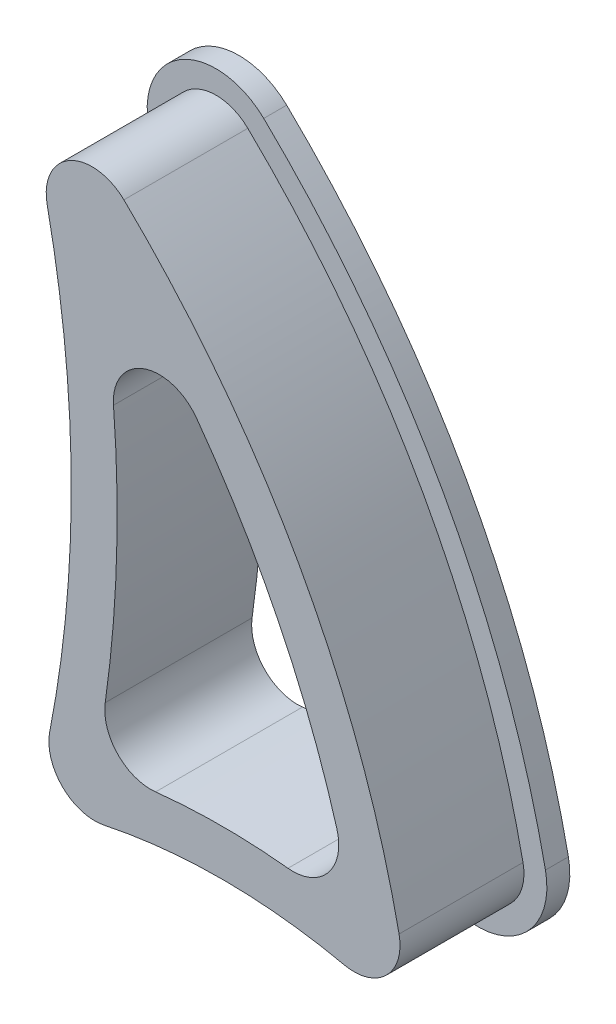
ISO-10303-21;
HEADER;
FILE_DESCRIPTION(('STEP AP214'),'2;1');
FILE_NAME('part.step','',(''),(''),'','','');
FILE_SCHEMA(('AUTOMOTIVE_DESIGN { 1 0 10303 214 1 1 1 1 }'));
ENDSEC;
DATA;
#1=APPLICATION_CONTEXT('core data for automotive mechanical design processes');
#2=APPLICATION_PROTOCOL_DEFINITION('international standard','automotive_design',2000,#1);
#3=PRODUCT_CONTEXT('',#1,'mechanical');
#4=PRODUCT('Part','Part','',(#3));
#5=PRODUCT_RELATED_PRODUCT_CATEGORY('part','',(#4));
#6=PRODUCT_DEFINITION_FORMATION('','',#4);
#7=PRODUCT_DEFINITION_CONTEXT('part definition',#1,'design');
#8=PRODUCT_DEFINITION('design','',#6,#7);
#9=PRODUCT_DEFINITION_SHAPE('','',#8);
#10=(LENGTH_UNIT() NAMED_UNIT(*) SI_UNIT(.MILLI.,.METRE.));
#11=(NAMED_UNIT(*) PLANE_ANGLE_UNIT() SI_UNIT($,.RADIAN.));
#12=(NAMED_UNIT(*) SI_UNIT($,.STERADIAN.) SOLID_ANGLE_UNIT());
#13=UNCERTAINTY_MEASURE_WITH_UNIT(LENGTH_MEASURE(1.E-05),#10,'distance_accuracy_value','');
#14=(GEOMETRIC_REPRESENTATION_CONTEXT(3) GLOBAL_UNCERTAINTY_ASSIGNED_CONTEXT((#13)) GLOBAL_UNIT_ASSIGNED_CONTEXT((#10,
#11,#12)) REPRESENTATION_CONTEXT('',''));
#15=CARTESIAN_POINT('',(0.,0.,0.));
#16=DIRECTION('',(0.,0.,1.));
#17=DIRECTION('',(1.,0.,0.));
#18=AXIS2_PLACEMENT_3D('',#15,#16,#17);
#19=CARTESIAN_POINT('',(-32.9135427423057,-5.35760316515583,6.4));
#20=DIRECTION('',(0.,0.,-1.));
#21=DIRECTION('',(-1.,0.,0.));
#22=AXIS2_PLACEMENT_3D('',#19,#20,#21);
#23=CYLINDRICAL_SURFACE('',#22,42.);
#24=CARTESIAN_POINT('',(-32.9135427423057,-5.35760316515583,6.4));
#25=DIRECTION('',(0.,0.,1.));
#26=DIRECTION('',(1.,0.,0.));
#27=AXIS2_PLACEMENT_3D('',#24,#25,#26);
#28=CIRCLE('',#27,42.);
#29=CARTESIAN_POINT('',(-3.78295376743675,24.8981200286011,6.4));
#30=VERTEX_POINT('',#29);
#31=CARTESIAN_POINT('',(8.20820517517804,3.18650873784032,6.4));
#32=VERTEX_POINT('',#31);
#33=EDGE_CURVE('E294',#30,#32,#28,.F.);
#34=ORIENTED_EDGE('',*,*,#33,.T.);
#35=DIRECTION('',(0.,0.,-1.));
#36=VECTOR('',#35,1.);
#37=CARTESIAN_POINT('',(8.20820517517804,3.18650873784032,6.4));
#38=LINE('',#37,#36);
#39=CARTESIAN_POINT('',(8.20820517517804,3.18650873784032,1.));
#40=VERTEX_POINT('',#39);
#41=EDGE_CURVE('E214',#32,#40,#38,.T.);
#42=ORIENTED_EDGE('',*,*,#41,.T.);
#43=CARTESIAN_POINT('',(-32.9135427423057,-5.35760316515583,1.));
#44=DIRECTION('',(0.,0.,1.));
#45=DIRECTION('',(1.,0.,0.));
#46=AXIS2_PLACEMENT_3D('',#43,#44,#45);
#47=CIRCLE('',#46,42.);
#48=CARTESIAN_POINT('',(-3.78295376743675,24.8981200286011,1.));
#49=VERTEX_POINT('',#48);
#50=EDGE_CURVE('E533',#49,#40,#47,.F.);
#51=ORIENTED_EDGE('',*,*,#50,.F.);
#52=DIRECTION('',(0.,0.,-1.));
#53=VECTOR('',#52,1.);
#54=CARTESIAN_POINT('',(-3.78295376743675,24.8981200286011,6.4));
#55=LINE('',#54,#53);
#56=EDGE_CURVE('E213',#49,#30,#55,.F.);
#57=ORIENTED_EDGE('',*,*,#56,.T.);
#58=EDGE_LOOP('',(#34,#42,#51,#57));
#59=FACE_BOUND('',#58,.T.);
#60=ADVANCED_FACE('F43',(#59),#23,.T.);
#61=CARTESIAN_POINT('',(-56.0769552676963,12.8510242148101,6.4));
#62=DIRECTION('',(0.,0.,-1.));
#63=DIRECTION('',(-1.,0.,0.));
#64=AXIS2_PLACEMENT_3D('',#61,#62,#63);
#65=CYLINDRICAL_SURFACE('',#64,50.);
#66=CARTESIAN_POINT('',(-56.0769552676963,12.8510242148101,1.));
#67=DIRECTION('',(0.,0.,1.));
#68=DIRECTION('',(1.,0.,0.));
#69=AXIS2_PLACEMENT_3D('',#66,#67,#68);
#70=CIRCLE('',#69,50.);
#71=CARTESIAN_POINT('',(-7.01518222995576,3.21035896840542,1.));
#72=VERTEX_POINT('',#71);
#73=CARTESIAN_POINT('',(-7.12807969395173,23.0494348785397,1.));
#74=VERTEX_POINT('',#73);
#75=EDGE_CURVE('E283',#72,#74,#70,.T.);
#76=ORIENTED_EDGE('',*,*,#75,.F.);
#77=DIRECTION('',(0.,0.,-1.));
#78=VECTOR('',#77,1.);
#79=CARTESIAN_POINT('',(-7.01518222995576,3.21035896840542,6.4));
#80=LINE('',#79,#78);
#81=CARTESIAN_POINT('',(-7.01518222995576,3.21035896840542,6.4));
#82=VERTEX_POINT('',#81);
#83=EDGE_CURVE('E234',#72,#82,#80,.F.);
#84=ORIENTED_EDGE('',*,*,#83,.T.);
#85=CARTESIAN_POINT('',(-56.0769552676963,12.8510242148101,6.4));
#86=DIRECTION('',(0.,0.,1.));
#87=DIRECTION('',(1.,0.,0.));
#88=AXIS2_PLACEMENT_3D('',#85,#86,#87);
#89=CIRCLE('',#88,50.);
#90=CARTESIAN_POINT('',(-7.12807969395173,23.0494348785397,6.4));
#91=VERTEX_POINT('',#90);
#92=EDGE_CURVE('E200',#82,#91,#89,.T.);
#93=ORIENTED_EDGE('',*,*,#92,.T.);
#94=DIRECTION('',(0.,0.,-1.));
#95=VECTOR('',#94,1.);
#96=CARTESIAN_POINT('',(-7.12807969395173,23.0494348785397,6.4));
#97=LINE('',#96,#95);
#98=EDGE_CURVE('E227',#91,#74,#97,.T.);
#99=ORIENTED_EDGE('',*,*,#98,.T.);
#100=EDGE_LOOP('',(#76,#84,#93,#99));
#101=FACE_BOUND('',#100,.T.);
#102=ADVANCED_FACE('F326',(#101),#65,.F.);
#103=CARTESIAN_POINT('',(0.493342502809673,-23.5995233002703,6.4));
#104=DIRECTION('',(0.,0.,-1.));
#105=DIRECTION('',(-1.,0.,0.));
#106=AXIS2_PLACEMENT_3D('',#103,#104,#105);
#107=CYLINDRICAL_SURFACE('',#106,27.);
#108=CARTESIAN_POINT('',(0.493342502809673,-23.5995233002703,6.4));
#109=DIRECTION('',(0.,0.,1.));
#110=DIRECTION('',(1.,0.,0.));
#111=AXIS2_PLACEMENT_3D('',#108,#109,#110);
#112=CIRCLE('',#111,27.);
#113=CARTESIAN_POINT('',(-2.40247687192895,3.24473549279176,6.4));
#114=VERTEX_POINT('',#113);
#115=CARTESIAN_POINT('',(3.367158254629,3.24710000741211,6.4));
#116=VERTEX_POINT('',#115);
#117=EDGE_CURVE('E287',#114,#116,#112,.F.);
#118=ORIENTED_EDGE('',*,*,#117,.T.);
#119=DIRECTION('',(0.,0.,-1.));
#120=VECTOR('',#119,1.);
#121=CARTESIAN_POINT('',(3.367158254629,3.24710000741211,6.4));
#122=LINE('',#121,#120);
#123=CARTESIAN_POINT('',(3.367158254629,3.24710000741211,0.));
#124=VERTEX_POINT('',#123);
#125=EDGE_CURVE('E187',#116,#124,#122,.T.);
#126=ORIENTED_EDGE('',*,*,#125,.T.);
#127=CARTESIAN_POINT('',(0.493342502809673,-23.5995233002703,0.));
#128=DIRECTION('',(0.,0.,1.));
#129=DIRECTION('',(1.,0.,0.));
#130=AXIS2_PLACEMENT_3D('',#127,#128,#129);
#131=CIRCLE('',#130,27.);
#132=CARTESIAN_POINT('',(-2.40247687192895,3.24473549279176,0.));
#133=VERTEX_POINT('',#132);
#134=EDGE_CURVE('E175',#133,#124,#131,.F.);
#135=ORIENTED_EDGE('',*,*,#134,.F.);
#136=DIRECTION('',(0.,0.,-1.));
#137=VECTOR('',#136,1.);
#138=CARTESIAN_POINT('',(-2.40247687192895,3.24473549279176,6.4));
#139=LINE('',#138,#137);
#140=EDGE_CURVE('E188',#133,#114,#139,.F.);
#141=ORIENTED_EDGE('',*,*,#140,.T.);
#142=EDGE_LOOP('',(#118,#126,#135,#141));
#143=FACE_BOUND('',#142,.T.);
#144=ADVANCED_FACE('F183',(#143),#107,.T.);
#145=CARTESIAN_POINT('',(-56.0769552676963,12.8510242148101,6.4));
#146=DIRECTION('',(0.,0.,-1.));
#147=DIRECTION('',(-1.,0.,0.));
#148=AXIS2_PLACEMENT_3D('',#145,#146,#147);
#149=CYLINDRICAL_SURFACE('',#148,52.);
#150=CARTESIAN_POINT('',(-56.0769552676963,12.8510242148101,6.4));
#151=DIRECTION('',(0.,0.,1.));
#152=DIRECTION('',(1.,0.,0.));
#153=AXIS2_PLACEMENT_3D('',#150,#151,#152);
#154=CIRCLE('',#153,52.);
#155=CARTESIAN_POINT('',(-4.59698102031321,5.51534077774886,6.4));
#156=VERTEX_POINT('',#155);
#157=CARTESIAN_POINT('',(-4.23639748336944,16.9200005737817,6.4));
#158=VERTEX_POINT('',#157);
#159=EDGE_CURVE('E290',#156,#158,#154,.T.);
#160=ORIENTED_EDGE('',*,*,#159,.F.);
#161=DIRECTION('',(0.,0.,-1.));
#162=VECTOR('',#161,1.);
#163=CARTESIAN_POINT('',(-4.59698102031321,5.51534077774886,6.4));
#164=LINE('',#163,#162);
#165=CARTESIAN_POINT('',(-4.59698102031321,5.51534077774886,0.));
#166=VERTEX_POINT('',#165);
#167=EDGE_CURVE('E211',#156,#166,#164,.T.);
#168=ORIENTED_EDGE('',*,*,#167,.T.);
#169=CARTESIAN_POINT('',(-56.0769552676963,12.8510242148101,0.));
#170=DIRECTION('',(0.,0.,1.));
#171=DIRECTION('',(1.,0.,0.));
#172=AXIS2_PLACEMENT_3D('',#169,#170,#171);
#173=CIRCLE('',#172,52.);
#174=CARTESIAN_POINT('',(-4.23639748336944,16.9200005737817,0.));
#175=VERTEX_POINT('',#174);
#176=EDGE_CURVE('E172',#166,#175,#173,.T.);
#177=ORIENTED_EDGE('',*,*,#176,.T.);
#178=DIRECTION('',(0.,0.,-1.));
#179=VECTOR('',#178,1.);
#180=CARTESIAN_POINT('',(-4.23639748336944,16.9200005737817,6.4));
#181=LINE('',#180,#179);
#182=EDGE_CURVE('E207',#175,#158,#181,.F.);
#183=ORIENTED_EDGE('',*,*,#182,.T.);
#184=EDGE_LOOP('',(#160,#168,#177,#183));
#185=FACE_BOUND('',#184,.T.);
#186=ADVANCED_FACE('F320',(#185),#149,.T.);
#187=CARTESIAN_POINT('',(-32.9135427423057,-5.35760316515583,6.4));
#188=DIRECTION('',(0.,0.,-1.));
#189=DIRECTION('',(-1.,0.,0.));
#190=AXIS2_PLACEMENT_3D('',#187,#188,#189);
#191=CYLINDRICAL_SURFACE('',#190,40.);
#192=CARTESIAN_POINT('',(-32.9135427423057,-5.35760316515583,0.));
#193=DIRECTION('',(0.,0.,1.));
#194=DIRECTION('',(1.,0.,0.));
#195=AXIS2_PLACEMENT_3D('',#192,#193,#194);
#196=CIRCLE('',#195,40.);
#197=CARTESIAN_POINT('',(-0.628266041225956,18.2572419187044,0.));
#198=VERTEX_POINT('',#197);
#199=CARTESIAN_POINT('',(5.50074803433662,5.79328308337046,0.));
#200=VERTEX_POINT('',#199);
#201=EDGE_CURVE('E205',#198,#200,#196,.F.);
#202=ORIENTED_EDGE('',*,*,#201,.T.);
#203=DIRECTION('',(0.,0.,-1.));
#204=VECTOR('',#203,1.);
#205=CARTESIAN_POINT('',(5.50074803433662,5.79328308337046,6.4));
#206=LINE('',#205,#204);
#207=CARTESIAN_POINT('',(5.50074803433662,5.79328308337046,6.4));
#208=VERTEX_POINT('',#207);
#209=EDGE_CURVE('E210',#200,#208,#206,.F.);
#210=ORIENTED_EDGE('',*,*,#209,.T.);
#211=CARTESIAN_POINT('',(-32.9135427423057,-5.35760316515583,6.4));
#212=DIRECTION('',(0.,0.,1.));
#213=DIRECTION('',(1.,0.,0.));
#214=AXIS2_PLACEMENT_3D('',#211,#212,#213);
#215=CIRCLE('',#214,40.);
#216=CARTESIAN_POINT('',(-0.628266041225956,18.2572419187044,6.4));
#217=VERTEX_POINT('',#216);
#218=EDGE_CURVE('E292',#217,#208,#215,.F.);
#219=ORIENTED_EDGE('',*,*,#218,.F.);
#220=DIRECTION('',(0.,0.,-1.));
#221=VECTOR('',#220,1.);
#222=CARTESIAN_POINT('',(-0.628266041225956,18.2572419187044,6.4));
#223=LINE('',#222,#221);
#224=EDGE_CURVE('E198',#217,#198,#223,.T.);
#225=ORIENTED_EDGE('',*,*,#224,.T.);
#226=EDGE_LOOP('',(#202,#210,#219,#225));
#227=FACE_BOUND('',#226,.T.);
#228=ADVANCED_FACE('F301',(#227),#191,.F.);
#229=CARTESIAN_POINT('',(0.493342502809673,-23.5995233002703,6.4));
#230=DIRECTION('',(0.,0.,-1.));
#231=DIRECTION('',(-1.,0.,0.));
#232=AXIS2_PLACEMENT_3D('',#229,#230,#231);
#233=CYLINDRICAL_SURFACE('',#232,25.);
#234=CARTESIAN_POINT('',(0.493342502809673,-23.5995233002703,1.));
#235=DIRECTION('',(0.,0.,1.));
#236=DIRECTION('',(1.,0.,0.));
#237=AXIS2_PLACEMENT_3D('',#234,#235,#236);
#238=CIRCLE('',#237,25.);
#239=CARTESIAN_POINT('',(-4.64189250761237,0.867380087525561,1.));
#240=VERTEX_POINT('',#239);
#241=CARTESIAN_POINT('',(5.82360565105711,0.82563370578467,1.));
#242=VERTEX_POINT('',#241);
#243=EDGE_CURVE('E365',#240,#242,#238,.F.);
#244=ORIENTED_EDGE('',*,*,#243,.T.);
#245=DIRECTION('',(0.,0.,-1.));
#246=VECTOR('',#245,1.);
#247=CARTESIAN_POINT('',(5.82360565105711,0.825633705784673,6.4));
#248=LINE('',#247,#246);
#249=CARTESIAN_POINT('',(5.82360565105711,0.82563370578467,6.4));
#250=VERTEX_POINT('',#249);
#251=EDGE_CURVE('E222',#242,#250,#248,.F.);
#252=ORIENTED_EDGE('',*,*,#251,.T.);
#253=CARTESIAN_POINT('',(0.493342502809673,-23.5995233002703,6.4));
#254=DIRECTION('',(0.,0.,1.));
#255=DIRECTION('',(1.,0.,0.));
#256=AXIS2_PLACEMENT_3D('',#253,#254,#255);
#257=CIRCLE('',#256,25.);
#258=CARTESIAN_POINT('',(-4.64189250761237,0.867380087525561,6.4));
#259=VERTEX_POINT('',#258);
#260=EDGE_CURVE('E191',#259,#250,#257,.F.);
#261=ORIENTED_EDGE('',*,*,#260,.F.);
#262=DIRECTION('',(0.,0.,-1.));
#263=VECTOR('',#262,1.);
#264=CARTESIAN_POINT('',(-4.64189250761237,0.867380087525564,6.4));
#265=LINE('',#264,#263);
#266=EDGE_CURVE('E217',#259,#240,#265,.T.);
#267=ORIENTED_EDGE('',*,*,#266,.T.);
#268=EDGE_LOOP('',(#244,#252,#261,#267));
#269=FACE_BOUND('',#268,.T.);
#270=ADVANCED_FACE('F322',(#269),#233,.F.);
#271=CARTESIAN_POINT('',(0.,0.,6.4));
#272=DIRECTION('',(0.,0.,1.));
#273=DIRECTION('',(1.,0.,0.));
#274=AXIS2_PLACEMENT_3D('',#271,#272,#273);
#275=PLANE('',#274);
#276=ORIENTED_EDGE('',*,*,#117,.F.);
#277=CARTESIAN_POINT('',(-2.61698201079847,5.23319910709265,6.4));
#278=DIRECTION('',(0.,0.,1.));
#279=DIRECTION('',(1.,0.,0.));
#280=AXIS2_PLACEMENT_3D('',#277,#278,#279);
#281=CIRCLE('',#280,2.);
#282=EDGE_CURVE('E176',#114,#156,#281,.F.);
#283=ORIENTED_EDGE('',*,*,#282,.T.);
#284=ORIENTED_EDGE('',*,*,#159,.T.);
#285=CARTESIAN_POINT('',(-2.24252987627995,17.0764996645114,6.4));
#286=DIRECTION('',(0.,0.,1.));
#287=DIRECTION('',(1.,0.,0.));
#288=AXIS2_PLACEMENT_3D('',#285,#286,#287);
#289=CIRCLE('',#288,2.);
#290=EDGE_CURVE('E242',#158,#217,#289,.F.);
#291=ORIENTED_EDGE('',*,*,#290,.T.);
#292=ORIENTED_EDGE('',*,*,#218,.T.);
#293=CARTESIAN_POINT('',(3.5800334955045,5.23573877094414,6.4));
#294=DIRECTION('',(0.,0.,1.));
#295=DIRECTION('',(1.,0.,0.));
#296=AXIS2_PLACEMENT_3D('',#293,#294,#295);
#297=CIRCLE('',#296,2.);
#298=EDGE_CURVE('E178',#208,#116,#297,.F.);
#299=ORIENTED_EDGE('',*,*,#298,.T.);
#300=EDGE_LOOP('',(#276,#283,#284,#291,#292,#299));
#301=FACE_BOUND('',#300,.T.);
#302=ORIENTED_EDGE('',*,*,#260,.T.);
#303=CARTESIAN_POINT('',(6.25002670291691,2.77964626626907,6.4));
#304=DIRECTION('',(0.,0.,1.));
#305=DIRECTION('',(1.,0.,0.));
#306=AXIS2_PLACEMENT_3D('',#303,#304,#305);
#307=CIRCLE('',#306,2.);
#308=EDGE_CURVE('E230',#250,#32,#307,.T.);
#309=ORIENTED_EDGE('',*,*,#308,.T.);
#310=ORIENTED_EDGE('',*,*,#33,.F.);
#311=CARTESIAN_POINT('',(-5.17012467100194,23.4573713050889,6.4));
#312=DIRECTION('',(0.,0.,1.));
#313=DIRECTION('',(1.,0.,0.));
#314=AXIS2_PLACEMENT_3D('',#311,#312,#313);
#315=CIRCLE('',#314,2.);
#316=EDGE_CURVE('E224',#30,#91,#315,.T.);
#317=ORIENTED_EDGE('',*,*,#316,.T.);
#318=ORIENTED_EDGE('',*,*,#92,.F.);
#319=CARTESIAN_POINT('',(-5.05271130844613,2.82473235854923,6.4));
#320=DIRECTION('',(0.,0.,1.));
#321=DIRECTION('',(1.,0.,0.));
#322=AXIS2_PLACEMENT_3D('',#319,#320,#321);
#323=CIRCLE('',#322,2.);
#324=EDGE_CURVE('E223',#82,#259,#323,.T.);
#325=ORIENTED_EDGE('',*,*,#324,.T.);
#326=EDGE_LOOP('',(#302,#309,#310,#317,#318,#325));
#327=FACE_BOUND('',#326,.T.);
#328=ADVANCED_FACE('F313',(#301,#327),#275,.T.);
#329=CARTESIAN_POINT('',(0.,0.,0.));
#330=DIRECTION('',(0.,0.,1.));
#331=DIRECTION('',(1.,0.,0.));
#332=AXIS2_PLACEMENT_3D('',#329,#330,#331);
#333=PLANE('',#332);
#334=ORIENTED_EDGE('',*,*,#176,.F.);
#335=CARTESIAN_POINT('',(-2.61698201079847,5.23319910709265,0.));
#336=DIRECTION('',(0.,0.,1.));
#337=DIRECTION('',(1.,0.,0.));
#338=AXIS2_PLACEMENT_3D('',#335,#336,#337);
#339=CIRCLE('',#338,2.);
#340=EDGE_CURVE('E169',#166,#133,#339,.T.);
#341=ORIENTED_EDGE('',*,*,#340,.T.);
#342=ORIENTED_EDGE('',*,*,#134,.T.);
#343=CARTESIAN_POINT('',(3.5800334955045,5.23573877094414,0.));
#344=DIRECTION('',(0.,0.,1.));
#345=DIRECTION('',(1.,0.,0.));
#346=AXIS2_PLACEMENT_3D('',#343,#344,#345);
#347=CIRCLE('',#346,2.);
#348=EDGE_CURVE('E231',#124,#200,#347,.T.);
#349=ORIENTED_EDGE('',*,*,#348,.T.);
#350=ORIENTED_EDGE('',*,*,#201,.F.);
#351=CARTESIAN_POINT('',(-2.24252987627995,17.0764996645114,0.));
#352=DIRECTION('',(0.,0.,1.));
#353=DIRECTION('',(1.,0.,0.));
#354=AXIS2_PLACEMENT_3D('',#351,#352,#353);
#355=CIRCLE('',#354,2.);
#356=EDGE_CURVE('E245',#198,#175,#355,.T.);
#357=ORIENTED_EDGE('',*,*,#356,.T.);
#358=EDGE_LOOP('',(#334,#341,#342,#349,#350,#357));
#359=FACE_BOUND('',#358,.T.);
#360=CARTESIAN_POINT('',(-56.0769552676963,12.8510242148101,0.));
#361=DIRECTION('',(0.,0.,1.));
#362=DIRECTION('',(1.,0.,0.));
#363=AXIS2_PLACEMENT_3D('',#360,#361,#362);
#364=CIRCLE('',#363,49.);
#365=CARTESIAN_POINT('',(-7.99641769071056,3.40317227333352,0.));
#366=VERTEX_POINT('',#365);
#367=CARTESIAN_POINT('',(-8.10705720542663,22.8454666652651,0.));
#368=VERTEX_POINT('',#367);
#369=EDGE_CURVE('E276',#366,#368,#364,.T.);
#370=ORIENTED_EDGE('',*,*,#369,.T.);
#371=CARTESIAN_POINT('',(-5.17012467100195,23.4573713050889,0.));
#372=DIRECTION('',(0.,0.,1.));
#373=DIRECTION('',(1.,0.,0.));
#374=AXIS2_PLACEMENT_3D('',#371,#372,#373);
#375=CIRCLE('',#374,3.);
#376=CARTESIAN_POINT('',(-3.08936831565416,25.6184943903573,0.));
#377=VERTEX_POINT('',#376);
#378=EDGE_CURVE('E260',#368,#377,#375,.F.);
#379=ORIENTED_EDGE('',*,*,#378,.T.);
#380=CARTESIAN_POINT('',(-32.9135427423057,-5.35760316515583,0.));
#381=DIRECTION('',(0.,0.,1.));
#382=DIRECTION('',(1.,0.,0.));
#383=AXIS2_PLACEMENT_3D('',#380,#381,#382);
#384=CIRCLE('',#383,43.);
#385=CARTESIAN_POINT('',(9.18729441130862,3.38993997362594,0.));
#386=VERTEX_POINT('',#385);
#387=EDGE_CURVE('E279',#377,#386,#384,.F.);
#388=ORIENTED_EDGE('',*,*,#387,.T.);
#389=CARTESIAN_POINT('',(6.25002670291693,2.77964626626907,0.));
#390=DIRECTION('',(0.,0.,1.));
#391=DIRECTION('',(1.,0.,0.));
#392=AXIS2_PLACEMENT_3D('',#389,#390,#391);
#393=CIRCLE('',#392,3.);
#394=CARTESIAN_POINT('',(5.61039512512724,-0.151372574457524,0.));
#395=VERTEX_POINT('',#394);
#396=EDGE_CURVE('E254',#386,#395,#393,.F.);
#397=ORIENTED_EDGE('',*,*,#396,.T.);
#398=CARTESIAN_POINT('',(0.493342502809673,-23.5995233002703,0.));
#399=DIRECTION('',(0.,0.,1.));
#400=DIRECTION('',(1.,0.,0.));
#401=AXIS2_PLACEMENT_3D('',#398,#399,#400);
#402=CIRCLE('',#401,24.);
#403=CARTESIAN_POINT('',(-4.43648310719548,-0.111296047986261,0.));
#404=VERTEX_POINT('',#403);
#405=EDGE_CURVE('E275',#404,#395,#402,.F.);
#406=ORIENTED_EDGE('',*,*,#405,.F.);
#407=CARTESIAN_POINT('',(-5.05271130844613,2.82473235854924,0.));
#408=DIRECTION('',(0.,0.,1.));
#409=DIRECTION('',(1.,0.,0.));
#410=AXIS2_PLACEMENT_3D('',#407,#408,#409);
#411=CIRCLE('',#410,3.);
#412=EDGE_CURVE('E251',#404,#366,#411,.F.);
#413=ORIENTED_EDGE('',*,*,#412,.T.);
#414=EDGE_LOOP('',(#370,#379,#388,#397,#406,#413));
#415=FACE_BOUND('',#414,.T.);
#416=ADVANCED_FACE('F168',(#359,#415),#333,.F.);
#417=CARTESIAN_POINT('',(-56.0769552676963,12.8510242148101,1.));
#418=DIRECTION('',(0.,0.,-1.));
#419=DIRECTION('',(-1.,0.,0.));
#420=AXIS2_PLACEMENT_3D('',#417,#418,#419);
#421=CYLINDRICAL_SURFACE('',#420,49.);
#422=CARTESIAN_POINT('',(-56.0769552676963,12.8510242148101,1.));
#423=DIRECTION('',(0.,0.,1.));
#424=DIRECTION('',(1.,0.,0.));
#425=AXIS2_PLACEMENT_3D('',#422,#423,#424);
#426=CIRCLE('',#425,49.);
#427=CARTESIAN_POINT('',(-7.99641769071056,3.40317227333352,1.));
#428=VERTEX_POINT('',#427);
#429=CARTESIAN_POINT('',(-8.10705720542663,22.8454666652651,1.));
#430=VERTEX_POINT('',#429);
#431=EDGE_CURVE('E376',#428,#430,#426,.T.);
#432=ORIENTED_EDGE('',*,*,#431,.T.);
#433=DIRECTION('',(0.,0.,-1.));
#434=VECTOR('',#433,1.);
#435=CARTESIAN_POINT('',(-8.10705720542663,22.8454666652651,1.));
#436=LINE('',#435,#434);
#437=EDGE_CURVE('E248',#430,#368,#436,.T.);
#438=ORIENTED_EDGE('',*,*,#437,.T.);
#439=ORIENTED_EDGE('',*,*,#369,.F.);
#440=DIRECTION('',(0.,0.,-1.));
#441=VECTOR('',#440,1.);
#442=CARTESIAN_POINT('',(-7.99641769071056,3.40317227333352,1.));
#443=LINE('',#442,#441);
#444=EDGE_CURVE('E250',#366,#428,#443,.F.);
#445=ORIENTED_EDGE('',*,*,#444,.T.);
#446=EDGE_LOOP('',(#432,#438,#439,#445));
#447=FACE_BOUND('',#446,.T.);
#448=ADVANCED_FACE('F344',(#447),#421,.F.);
#449=CARTESIAN_POINT('',(0.493342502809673,-23.5995233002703,1.));
#450=DIRECTION('',(0.,0.,-1.));
#451=DIRECTION('',(-1.,0.,0.));
#452=AXIS2_PLACEMENT_3D('',#449,#450,#451);
#453=CYLINDRICAL_SURFACE('',#452,24.);
#454=ORIENTED_EDGE('',*,*,#405,.T.);
#455=DIRECTION('',(0.,0.,-1.));
#456=VECTOR('',#455,1.);
#457=CARTESIAN_POINT('',(5.61039512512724,-0.151372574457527,1.));
#458=LINE('',#457,#456);
#459=CARTESIAN_POINT('',(5.61039512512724,-0.151372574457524,1.));
#460=VERTEX_POINT('',#459);
#461=EDGE_CURVE('E11',#395,#460,#458,.F.);
#462=ORIENTED_EDGE('',*,*,#461,.T.);
#463=CARTESIAN_POINT('',(0.493342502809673,-23.5995233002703,1.));
#464=DIRECTION('',(0.,0.,1.));
#465=DIRECTION('',(1.,0.,0.));
#466=AXIS2_PLACEMENT_3D('',#463,#464,#465);
#467=CIRCLE('',#466,24.);
#468=CARTESIAN_POINT('',(-4.43648310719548,-0.111296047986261,1.));
#469=VERTEX_POINT('',#468);
#470=EDGE_CURVE('E272',#469,#460,#467,.F.);
#471=ORIENTED_EDGE('',*,*,#470,.F.);
#472=DIRECTION('',(0.,0.,-1.));
#473=VECTOR('',#472,1.);
#474=CARTESIAN_POINT('',(-4.43648310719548,-0.111296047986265,1.));
#475=LINE('',#474,#473);
#476=EDGE_CURVE('E51',#469,#404,#475,.T.);
#477=ORIENTED_EDGE('',*,*,#476,.T.);
#478=EDGE_LOOP('',(#454,#462,#471,#477));
#479=FACE_BOUND('',#478,.T.);
#480=ADVANCED_FACE('F271',(#479),#453,.F.);
#481=CARTESIAN_POINT('',(-32.9135427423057,-5.35760316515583,1.));
#482=DIRECTION('',(0.,0.,-1.));
#483=DIRECTION('',(-1.,0.,0.));
#484=AXIS2_PLACEMENT_3D('',#481,#482,#483);
#485=CYLINDRICAL_SURFACE('',#484,43.);
#486=ORIENTED_EDGE('',*,*,#387,.F.);
#487=DIRECTION('',(0.,0.,-1.));
#488=VECTOR('',#487,1.);
#489=CARTESIAN_POINT('',(-3.08936831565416,25.6184943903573,1.));
#490=LINE('',#489,#488);
#491=CARTESIAN_POINT('',(-3.08936831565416,25.6184943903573,1.));
#492=VERTEX_POINT('',#491);
#493=EDGE_CURVE('E265',#377,#492,#490,.F.);
#494=ORIENTED_EDGE('',*,*,#493,.T.);
#495=CARTESIAN_POINT('',(-32.9135427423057,-5.35760316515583,1.));
#496=DIRECTION('',(0.,0.,1.));
#497=DIRECTION('',(1.,0.,0.));
#498=AXIS2_PLACEMENT_3D('',#495,#496,#497);
#499=CIRCLE('',#498,43.);
#500=CARTESIAN_POINT('',(9.18729441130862,3.38993997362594,1.));
#501=VERTEX_POINT('',#500);
#502=EDGE_CURVE('E189',#492,#501,#499,.F.);
#503=ORIENTED_EDGE('',*,*,#502,.T.);
#504=DIRECTION('',(0.,0.,-1.));
#505=VECTOR('',#504,1.);
#506=CARTESIAN_POINT('',(9.18729441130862,3.38993997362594,1.));
#507=LINE('',#506,#505);
#508=EDGE_CURVE('E259',#501,#386,#507,.T.);
#509=ORIENTED_EDGE('',*,*,#508,.T.);
#510=EDGE_LOOP('',(#486,#494,#503,#509));
#511=FACE_BOUND('',#510,.T.);
#512=ADVANCED_FACE('F348',(#511),#485,.T.);
#513=CARTESIAN_POINT('',(0.,0.,1.));
#514=DIRECTION('',(0.,0.,1.));
#515=DIRECTION('',(1.,0.,0.));
#516=AXIS2_PLACEMENT_3D('',#513,#514,#515);
#517=PLANE('',#516);
#518=ORIENTED_EDGE('',*,*,#243,.F.);
#519=CARTESIAN_POINT('',(-5.05271130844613,2.82473235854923,1.));
#520=DIRECTION('',(0.,0.,1.));
#521=DIRECTION('',(1.,0.,0.));
#522=AXIS2_PLACEMENT_3D('',#519,#520,#521);
#523=CIRCLE('',#522,2.);
#524=EDGE_CURVE('E238',#240,#72,#523,.F.);
#525=ORIENTED_EDGE('',*,*,#524,.T.);
#526=ORIENTED_EDGE('',*,*,#75,.T.);
#527=CARTESIAN_POINT('',(-5.17012467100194,23.4573713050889,1.));
#528=DIRECTION('',(0.,0.,1.));
#529=DIRECTION('',(1.,0.,0.));
#530=AXIS2_PLACEMENT_3D('',#527,#528,#529);
#531=CIRCLE('',#530,2.);
#532=EDGE_CURVE('E247',#74,#49,#531,.F.);
#533=ORIENTED_EDGE('',*,*,#532,.T.);
#534=ORIENTED_EDGE('',*,*,#50,.T.);
#535=CARTESIAN_POINT('',(6.25002670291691,2.77964626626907,1.));
#536=DIRECTION('',(0.,0.,1.));
#537=DIRECTION('',(1.,0.,0.));
#538=AXIS2_PLACEMENT_3D('',#535,#536,#537);
#539=CIRCLE('',#538,2.);
#540=EDGE_CURVE('E236',#40,#242,#539,.F.);
#541=ORIENTED_EDGE('',*,*,#540,.T.);
#542=EDGE_LOOP('',(#518,#525,#526,#533,#534,#541));
#543=FACE_BOUND('',#542,.T.);
#544=ORIENTED_EDGE('',*,*,#502,.F.);
#545=CARTESIAN_POINT('',(-5.17012467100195,23.4573713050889,1.));
#546=DIRECTION('',(0.,0.,1.));
#547=DIRECTION('',(1.,0.,0.));
#548=AXIS2_PLACEMENT_3D('',#545,#546,#547);
#549=CIRCLE('',#548,3.);
#550=EDGE_CURVE('E270',#492,#430,#549,.T.);
#551=ORIENTED_EDGE('',*,*,#550,.T.);
#552=ORIENTED_EDGE('',*,*,#431,.F.);
#553=CARTESIAN_POINT('',(-5.05271130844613,2.82473235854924,1.));
#554=DIRECTION('',(0.,0.,1.));
#555=DIRECTION('',(1.,0.,0.));
#556=AXIS2_PLACEMENT_3D('',#553,#554,#555);
#557=CIRCLE('',#556,3.);
#558=EDGE_CURVE('E61',#428,#469,#557,.T.);
#559=ORIENTED_EDGE('',*,*,#558,.T.);
#560=ORIENTED_EDGE('',*,*,#470,.T.);
#561=CARTESIAN_POINT('',(6.25002670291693,2.77964626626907,1.));
#562=DIRECTION('',(0.,0.,1.));
#563=DIRECTION('',(1.,0.,0.));
#564=AXIS2_PLACEMENT_3D('',#561,#562,#563);
#565=CIRCLE('',#564,3.);
#566=EDGE_CURVE('E264',#460,#501,#565,.T.);
#567=ORIENTED_EDGE('',*,*,#566,.T.);
#568=EDGE_LOOP('',(#544,#551,#552,#559,#560,#567));
#569=FACE_BOUND('',#568,.T.);
#570=ADVANCED_FACE('F351',(#543,#569),#517,.T.);
#571=CARTESIAN_POINT('',(3.5800334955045,5.23573877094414,6.4));
#572=DIRECTION('',(0.,0.,-1.));
#573=DIRECTION('',(-1.,0.,0.));
#574=AXIS2_PLACEMENT_3D('',#571,#572,#573);
#575=CYLINDRICAL_SURFACE('',#574,2.);
#576=ORIENTED_EDGE('',*,*,#298,.F.);
#577=ORIENTED_EDGE('',*,*,#209,.F.);
#578=ORIENTED_EDGE('',*,*,#348,.F.);
#579=ORIENTED_EDGE('',*,*,#125,.F.);
#580=EDGE_LOOP('',(#576,#577,#578,#579));
#581=FACE_BOUND('',#580,.T.);
#582=ADVANCED_FACE('F310',(#581),#575,.F.);
#583=CARTESIAN_POINT('',(-2.61698201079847,5.23319910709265,6.4));
#584=DIRECTION('',(0.,0.,1.));
#585=DIRECTION('',(1.,0.,0.));
#586=AXIS2_PLACEMENT_3D('',#583,#584,#585);
#587=CYLINDRICAL_SURFACE('',#586,2.);
#588=ORIENTED_EDGE('',*,*,#282,.F.);
#589=ORIENTED_EDGE('',*,*,#140,.F.);
#590=ORIENTED_EDGE('',*,*,#340,.F.);
#591=ORIENTED_EDGE('',*,*,#167,.F.);
#592=EDGE_LOOP('',(#588,#589,#590,#591));
#593=FACE_BOUND('',#592,.T.);
#594=ADVANCED_FACE('F195',(#593),#587,.F.);
#595=CARTESIAN_POINT('',(6.25002670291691,2.77964626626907,6.4));
#596=DIRECTION('',(0.,0.,1.));
#597=DIRECTION('',(1.,0.,0.));
#598=AXIS2_PLACEMENT_3D('',#595,#596,#597);
#599=CYLINDRICAL_SURFACE('',#598,2.);
#600=ORIENTED_EDGE('',*,*,#308,.F.);
#601=ORIENTED_EDGE('',*,*,#251,.F.);
#602=ORIENTED_EDGE('',*,*,#540,.F.);
#603=ORIENTED_EDGE('',*,*,#41,.F.);
#604=EDGE_LOOP('',(#600,#601,#602,#603));
#605=FACE_BOUND('',#604,.T.);
#606=ADVANCED_FACE('F394',(#605),#599,.T.);
#607=CARTESIAN_POINT('',(-5.05271130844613,2.82473235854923,6.4));
#608=DIRECTION('',(0.,0.,-1.));
#609=DIRECTION('',(-1.,0.,0.));
#610=AXIS2_PLACEMENT_3D('',#607,#608,#609);
#611=CYLINDRICAL_SURFACE('',#610,2.);
#612=ORIENTED_EDGE('',*,*,#324,.F.);
#613=ORIENTED_EDGE('',*,*,#83,.F.);
#614=ORIENTED_EDGE('',*,*,#524,.F.);
#615=ORIENTED_EDGE('',*,*,#266,.F.);
#616=EDGE_LOOP('',(#612,#613,#614,#615));
#617=FACE_BOUND('',#616,.T.);
#618=ADVANCED_FACE('F395',(#617),#611,.T.);
#619=CARTESIAN_POINT('',(-2.24252987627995,17.0764996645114,6.4));
#620=DIRECTION('',(0.,0.,-1.));
#621=DIRECTION('',(-1.,0.,0.));
#622=AXIS2_PLACEMENT_3D('',#619,#620,#621);
#623=CYLINDRICAL_SURFACE('',#622,2.);
#624=ORIENTED_EDGE('',*,*,#290,.F.);
#625=ORIENTED_EDGE('',*,*,#182,.F.);
#626=ORIENTED_EDGE('',*,*,#356,.F.);
#627=ORIENTED_EDGE('',*,*,#224,.F.);
#628=EDGE_LOOP('',(#624,#625,#626,#627));
#629=FACE_BOUND('',#628,.T.);
#630=ADVANCED_FACE('F312',(#629),#623,.F.);
#631=CARTESIAN_POINT('',(-5.17012467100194,23.4573713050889,6.4));
#632=DIRECTION('',(0.,0.,1.));
#633=DIRECTION('',(1.,0.,0.));
#634=AXIS2_PLACEMENT_3D('',#631,#632,#633);
#635=CYLINDRICAL_SURFACE('',#634,2.);
#636=ORIENTED_EDGE('',*,*,#316,.F.);
#637=ORIENTED_EDGE('',*,*,#56,.F.);
#638=ORIENTED_EDGE('',*,*,#532,.F.);
#639=ORIENTED_EDGE('',*,*,#98,.F.);
#640=EDGE_LOOP('',(#636,#637,#638,#639));
#641=FACE_BOUND('',#640,.T.);
#642=ADVANCED_FACE('F383',(#641),#635,.T.);
#643=CARTESIAN_POINT('',(-5.17012467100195,23.4573713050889,1.));
#644=DIRECTION('',(0.,0.,1.));
#645=DIRECTION('',(1.,0.,0.));
#646=AXIS2_PLACEMENT_3D('',#643,#644,#645);
#647=CYLINDRICAL_SURFACE('',#646,3.);
#648=ORIENTED_EDGE('',*,*,#550,.F.);
#649=ORIENTED_EDGE('',*,*,#493,.F.);
#650=ORIENTED_EDGE('',*,*,#378,.F.);
#651=ORIENTED_EDGE('',*,*,#437,.F.);
#652=EDGE_LOOP('',(#648,#649,#650,#651));
#653=FACE_BOUND('',#652,.T.);
#654=ADVANCED_FACE('F372',(#653),#647,.T.);
#655=CARTESIAN_POINT('',(6.25002670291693,2.77964626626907,1.));
#656=DIRECTION('',(0.,0.,1.));
#657=DIRECTION('',(1.,0.,0.));
#658=AXIS2_PLACEMENT_3D('',#655,#656,#657);
#659=CYLINDRICAL_SURFACE('',#658,3.);
#660=ORIENTED_EDGE('',*,*,#566,.F.);
#661=ORIENTED_EDGE('',*,*,#461,.F.);
#662=ORIENTED_EDGE('',*,*,#396,.F.);
#663=ORIENTED_EDGE('',*,*,#508,.F.);
#664=EDGE_LOOP('',(#660,#661,#662,#663));
#665=FACE_BOUND('',#664,.T.);
#666=ADVANCED_FACE('F377',(#665),#659,.T.);
#667=CARTESIAN_POINT('',(-5.05271130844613,2.82473235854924,1.));
#668=DIRECTION('',(0.,0.,-1.));
#669=DIRECTION('',(-1.,0.,0.));
#670=AXIS2_PLACEMENT_3D('',#667,#668,#669);
#671=CYLINDRICAL_SURFACE('',#670,3.);
#672=ORIENTED_EDGE('',*,*,#558,.F.);
#673=ORIENTED_EDGE('',*,*,#444,.F.);
#674=ORIENTED_EDGE('',*,*,#412,.F.);
#675=ORIENTED_EDGE('',*,*,#476,.F.);
#676=EDGE_LOOP('',(#672,#673,#674,#675));
#677=FACE_BOUND('',#676,.T.);
#678=ADVANCED_FACE('F44',(#677),#671,.T.);
#679=CLOSED_SHELL('',(#60,#102,#144,#186,#228,#270,#328,#416,#448,#480,#512,#570,#582,#594,#606,
#618,#630,#642,#654,#666,#678));
#680=MANIFOLD_SOLID_BREP('B2',#679);
#681=ADVANCED_BREP_SHAPE_REPRESENTATION('',(#18,#680),#14);
#682=SHAPE_DEFINITION_REPRESENTATION(#9,#681);
ENDSEC;
END-ISO-10303-21;
